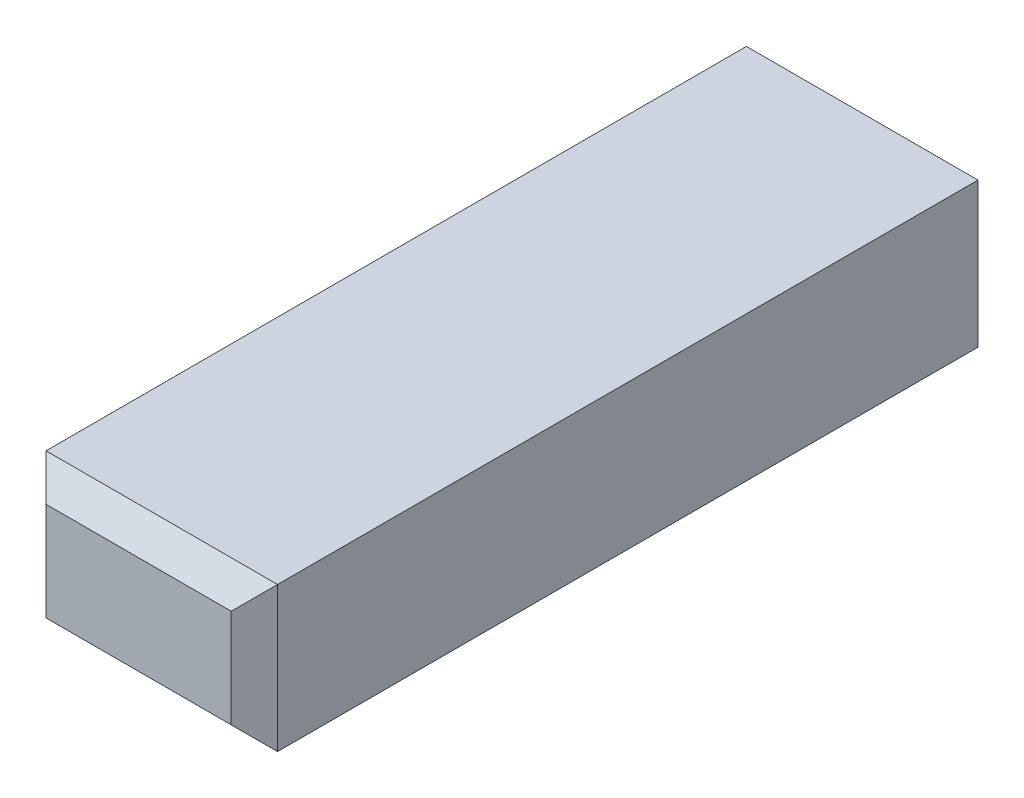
ISO-10303-21;
HEADER;
FILE_DESCRIPTION(('STEP AP214'),'2;1');
FILE_NAME('part.step','',(''),(''),'','','');
FILE_SCHEMA(('AUTOMOTIVE_DESIGN { 1 0 10303 214 1 1 1 1 }'));
ENDSEC;
DATA;
#1=APPLICATION_CONTEXT('core data for automotive mechanical design processes');
#2=APPLICATION_PROTOCOL_DEFINITION('international standard','automotive_design',2000,#1);
#3=PRODUCT_CONTEXT('',#1,'mechanical');
#4=PRODUCT('Part','Part','',(#3));
#5=PRODUCT_RELATED_PRODUCT_CATEGORY('part','',(#4));
#6=PRODUCT_DEFINITION_FORMATION('','',#4);
#7=PRODUCT_DEFINITION_CONTEXT('part definition',#1,'design');
#8=PRODUCT_DEFINITION('design','',#6,#7);
#9=PRODUCT_DEFINITION_SHAPE('','',#8);
#10=(LENGTH_UNIT() NAMED_UNIT(*) SI_UNIT(.MILLI.,.METRE.));
#11=(NAMED_UNIT(*) PLANE_ANGLE_UNIT() SI_UNIT($,.RADIAN.));
#12=(NAMED_UNIT(*) SI_UNIT($,.STERADIAN.) SOLID_ANGLE_UNIT());
#13=UNCERTAINTY_MEASURE_WITH_UNIT(LENGTH_MEASURE(1.E-05),#10,'distance_accuracy_value','');
#14=(GEOMETRIC_REPRESENTATION_CONTEXT(3) GLOBAL_UNCERTAINTY_ASSIGNED_CONTEXT((#13)) GLOBAL_UNIT_ASSIGNED_CONTEXT((#10,
#11,#12)) REPRESENTATION_CONTEXT('',''));
#15=CARTESIAN_POINT('',(0.,0.,0.));
#16=DIRECTION('',(0.,0.,1.));
#17=DIRECTION('',(1.,0.,0.));
#18=AXIS2_PLACEMENT_3D('',#15,#16,#17);
#19=CARTESIAN_POINT('',(8.,-5.,25.));
#20=DIRECTION('',(-1.,0.,0.));
#21=DIRECTION('',(0.,0.,1.));
#22=AXIS2_PLACEMENT_3D('',#19,#20,#21);
#23=PLANE('',#22);
#24=DIRECTION('',(0.,0.,-1.));
#25=VECTOR('',#24,1.);
#26=CARTESIAN_POINT('',(8.,5.,25.));
#27=LINE('',#26,#25);
#28=CARTESIAN_POINT('',(8.,5.,23.4));
#29=VERTEX_POINT('',#28);
#30=CARTESIAN_POINT('',(8.,5.,-25.));
#31=VERTEX_POINT('',#30);
#32=EDGE_CURVE('E84',#29,#31,#27,.T.);
#33=ORIENTED_EDGE('',*,*,#32,.F.);
#34=DIRECTION('',(0.,-1.,0.));
#35=VECTOR('',#34,1.);
#36=CARTESIAN_POINT('',(8.,-5.,23.4));
#37=LINE('',#36,#35);
#38=CARTESIAN_POINT('',(8.,-5.,23.4));
#39=VERTEX_POINT('',#38);
#40=EDGE_CURVE('E11',#29,#39,#37,.T.);
#41=ORIENTED_EDGE('',*,*,#40,.T.);
#42=DIRECTION('',(0.,0.,-1.));
#43=VECTOR('',#42,1.);
#44=CARTESIAN_POINT('',(8.,-5.,25.));
#45=LINE('',#44,#43);
#46=CARTESIAN_POINT('',(8.,-5.,-25.));
#47=VERTEX_POINT('',#46);
#48=EDGE_CURVE('E104',#39,#47,#45,.T.);
#49=ORIENTED_EDGE('',*,*,#48,.T.);
#50=DIRECTION('',(0.,1.,0.));
#51=VECTOR('',#50,1.);
#52=CARTESIAN_POINT('',(8.,-5.,-25.));
#53=LINE('',#52,#51);
#54=EDGE_CURVE('E99',#47,#31,#53,.T.);
#55=ORIENTED_EDGE('',*,*,#54,.T.);
#56=EDGE_LOOP('',(#33,#41,#49,#55));
#57=FACE_BOUND('',#56,.T.);
#58=ADVANCED_FACE('F32',(#57),#23,.F.);
#59=CARTESIAN_POINT('',(-8.,5.,25.));
#60=DIRECTION('',(0.,-1.,0.));
#61=DIRECTION('',(0.,0.,-1.));
#62=AXIS2_PLACEMENT_3D('',#59,#60,#61);
#63=PLANE('',#62);
#64=DIRECTION('',(0.,0.,-1.));
#65=VECTOR('',#64,1.);
#66=CARTESIAN_POINT('',(-8.,5.,25.));
#67=LINE('',#66,#65);
#68=CARTESIAN_POINT('',(-8.,5.,23.4));
#69=VERTEX_POINT('',#68);
#70=CARTESIAN_POINT('',(-8.,5.,-25.));
#71=VERTEX_POINT('',#70);
#72=EDGE_CURVE('E93',#69,#71,#67,.T.);
#73=ORIENTED_EDGE('',*,*,#72,.F.);
#74=DIRECTION('',(1.,0.,0.));
#75=VECTOR('',#74,1.);
#76=CARTESIAN_POINT('',(-8.,5.,23.4));
#77=LINE('',#76,#75);
#78=EDGE_CURVE('E41',#69,#29,#77,.T.);
#79=ORIENTED_EDGE('',*,*,#78,.T.);
#80=ORIENTED_EDGE('',*,*,#32,.T.);
#81=DIRECTION('',(-1.,0.,0.));
#82=VECTOR('',#81,1.);
#83=CARTESIAN_POINT('',(-8.,5.,-25.));
#84=LINE('',#83,#82);
#85=EDGE_CURVE('E87',#31,#71,#84,.T.);
#86=ORIENTED_EDGE('',*,*,#85,.T.);
#87=EDGE_LOOP('',(#73,#79,#80,#86));
#88=FACE_BOUND('',#87,.T.);
#89=ADVANCED_FACE('F86',(#88),#63,.F.);
#90=CARTESIAN_POINT('',(-8.,-5.,25.));
#91=DIRECTION('',(1.,0.,0.));
#92=DIRECTION('',(0.,0.,-1.));
#93=AXIS2_PLACEMENT_3D('',#90,#91,#92);
#94=PLANE('',#93);
#95=DIRECTION('',(0.,0.,-1.));
#96=VECTOR('',#95,1.);
#97=CARTESIAN_POINT('',(-8.,-5.,25.));
#98=LINE('',#97,#96);
#99=CARTESIAN_POINT('',(-8.,-5.,23.4));
#100=VERTEX_POINT('',#99);
#101=CARTESIAN_POINT('',(-8.,-5.,-25.));
#102=VERTEX_POINT('',#101);
#103=EDGE_CURVE('E114',#100,#102,#98,.T.);
#104=ORIENTED_EDGE('',*,*,#103,.F.);
#105=DIRECTION('',(0.,1.,0.));
#106=VECTOR('',#105,1.);
#107=CARTESIAN_POINT('',(-8.,-5.,23.4));
#108=LINE('',#107,#106);
#109=EDGE_CURVE('E56',#100,#69,#108,.T.);
#110=ORIENTED_EDGE('',*,*,#109,.T.);
#111=ORIENTED_EDGE('',*,*,#72,.T.);
#112=DIRECTION('',(0.,-1.,0.));
#113=VECTOR('',#112,1.);
#114=CARTESIAN_POINT('',(-8.,-5.,-25.));
#115=LINE('',#114,#113);
#116=EDGE_CURVE('E101',#71,#102,#115,.T.);
#117=ORIENTED_EDGE('',*,*,#116,.T.);
#118=EDGE_LOOP('',(#104,#110,#111,#117));
#119=FACE_BOUND('',#118,.T.);
#120=ADVANCED_FACE('F152',(#119),#94,.F.);
#121=CARTESIAN_POINT('',(-8.,-5.,25.));
#122=DIRECTION('',(0.,1.,0.));
#123=DIRECTION('',(0.,0.,1.));
#124=AXIS2_PLACEMENT_3D('',#121,#122,#123);
#125=PLANE('',#124);
#126=ORIENTED_EDGE('',*,*,#48,.F.);
#127=DIRECTION('',(-1.,0.,0.));
#128=VECTOR('',#127,1.);
#129=CARTESIAN_POINT('',(-8.,-5.,23.4));
#130=LINE('',#129,#128);
#131=EDGE_CURVE('E125',#39,#100,#130,.T.);
#132=ORIENTED_EDGE('',*,*,#131,.T.);
#133=ORIENTED_EDGE('',*,*,#103,.T.);
#134=DIRECTION('',(1.,0.,0.));
#135=VECTOR('',#134,1.);
#136=CARTESIAN_POINT('',(-8.,-5.,-25.));
#137=LINE('',#136,#135);
#138=EDGE_CURVE('E111',#102,#47,#137,.T.);
#139=ORIENTED_EDGE('',*,*,#138,.T.);
#140=EDGE_LOOP('',(#126,#132,#133,#139));
#141=FACE_BOUND('',#140,.T.);
#142=ADVANCED_FACE('F151',(#141),#125,.F.);
#143=CARTESIAN_POINT('',(0.,0.,25.));
#144=DIRECTION('',(0.,0.,-1.));
#145=DIRECTION('',(-1.,0.,0.));
#146=AXIS2_PLACEMENT_3D('',#143,#144,#145);
#147=PLANE('',#146);
#148=DIRECTION('',(0.,-1.,0.));
#149=VECTOR('',#148,1.);
#150=CARTESIAN_POINT('',(-6.39999999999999,0.,25.));
#151=LINE('',#150,#149);
#152=CARTESIAN_POINT('',(-6.39999999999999,3.39999999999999,25.));
#153=VERTEX_POINT('',#152);
#154=CARTESIAN_POINT('',(-6.39999999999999,-3.39999999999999,25.));
#155=VERTEX_POINT('',#154);
#156=EDGE_CURVE('E120',#153,#155,#151,.T.);
#157=ORIENTED_EDGE('',*,*,#156,.T.);
#158=DIRECTION('',(1.,0.,0.));
#159=VECTOR('',#158,1.);
#160=CARTESIAN_POINT('',(0.,-3.39999999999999,25.));
#161=LINE('',#160,#159);
#162=CARTESIAN_POINT('',(6.39999999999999,-3.39999999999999,25.));
#163=VERTEX_POINT('',#162);
#164=EDGE_CURVE('E122',#155,#163,#161,.T.);
#165=ORIENTED_EDGE('',*,*,#164,.T.);
#166=DIRECTION('',(0.,1.,0.));
#167=VECTOR('',#166,1.);
#168=CARTESIAN_POINT('',(6.39999999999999,0.,25.));
#169=LINE('',#168,#167);
#170=CARTESIAN_POINT('',(6.39999999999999,3.39999999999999,25.));
#171=VERTEX_POINT('',#170);
#172=EDGE_CURVE('E92',#163,#171,#169,.T.);
#173=ORIENTED_EDGE('',*,*,#172,.T.);
#174=DIRECTION('',(-1.,0.,0.));
#175=VECTOR('',#174,1.);
#176=CARTESIAN_POINT('',(0.,3.39999999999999,25.));
#177=LINE('',#176,#175);
#178=EDGE_CURVE('E118',#171,#153,#177,.T.);
#179=ORIENTED_EDGE('',*,*,#178,.T.);
#180=EDGE_LOOP('',(#157,#165,#173,#179));
#181=FACE_BOUND('',#180,.T.);
#182=ADVANCED_FACE('F144',(#181),#147,.F.);
#183=CARTESIAN_POINT('',(0.,0.,-25.));
#184=DIRECTION('',(0.,0.,-1.));
#185=DIRECTION('',(-1.,0.,0.));
#186=AXIS2_PLACEMENT_3D('',#183,#184,#185);
#187=PLANE('',#186);
#188=ORIENTED_EDGE('',*,*,#54,.F.);
#189=ORIENTED_EDGE('',*,*,#138,.F.);
#190=ORIENTED_EDGE('',*,*,#116,.F.);
#191=ORIENTED_EDGE('',*,*,#85,.F.);
#192=EDGE_LOOP('',(#188,#189,#190,#191));
#193=FACE_BOUND('',#192,.T.);
#194=ADVANCED_FACE('F97',(#193),#187,.T.);
#195=CARTESIAN_POINT('',(0.,3.39999999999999,25.));
#196=DIRECTION('',(0.,-0.707106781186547,-0.707106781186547));
#197=DIRECTION('',(-1.,0.,0.));
#198=AXIS2_PLACEMENT_3D('',#195,#196,#197);
#199=PLANE('',#198);
#200=DIRECTION('',(-0.577350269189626,-0.577350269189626,0.577350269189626));
#201=VECTOR('',#200,1.);
#202=CARTESIAN_POINT('',(5.26666666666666,2.26666666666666,26.1333333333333));
#203=LINE('',#202,#201);
#204=EDGE_CURVE('E108',#29,#171,#203,.T.);
#205=ORIENTED_EDGE('',*,*,#204,.F.);
#206=ORIENTED_EDGE('',*,*,#78,.F.);
#207=DIRECTION('',(0.577350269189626,-0.577350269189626,0.577350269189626));
#208=VECTOR('',#207,1.);
#209=CARTESIAN_POINT('',(-4.26666666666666,1.26666666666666,27.1333333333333));
#210=LINE('',#209,#208);
#211=EDGE_CURVE('E36',#153,#69,#210,.F.);
#212=ORIENTED_EDGE('',*,*,#211,.F.);
#213=ORIENTED_EDGE('',*,*,#178,.F.);
#214=EDGE_LOOP('',(#205,#206,#212,#213));
#215=FACE_BOUND('',#214,.T.);
#216=ADVANCED_FACE('F34',(#215),#199,.F.);
#217=CARTESIAN_POINT('',(-6.39999999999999,0.,25.));
#218=DIRECTION('',(0.707106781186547,0.,-0.707106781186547));
#219=DIRECTION('',(0.,-1.,0.));
#220=AXIS2_PLACEMENT_3D('',#217,#218,#219);
#221=PLANE('',#220);
#222=ORIENTED_EDGE('',*,*,#211,.T.);
#223=ORIENTED_EDGE('',*,*,#109,.F.);
#224=DIRECTION('',(0.577350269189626,0.577350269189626,0.577350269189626));
#225=VECTOR('',#224,1.);
#226=CARTESIAN_POINT('',(-5.26666666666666,-2.26666666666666,26.1333333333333));
#227=LINE('',#226,#225);
#228=EDGE_CURVE('E132',#155,#100,#227,.F.);
#229=ORIENTED_EDGE('',*,*,#228,.F.);
#230=ORIENTED_EDGE('',*,*,#156,.F.);
#231=EDGE_LOOP('',(#222,#223,#229,#230));
#232=FACE_BOUND('',#231,.T.);
#233=ADVANCED_FACE('F169',(#232),#221,.F.);
#234=CARTESIAN_POINT('',(6.39999999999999,0.,25.));
#235=DIRECTION('',(-0.707106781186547,0.,-0.707106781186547));
#236=DIRECTION('',(0.,1.,0.));
#237=AXIS2_PLACEMENT_3D('',#234,#235,#236);
#238=PLANE('',#237);
#239=ORIENTED_EDGE('',*,*,#204,.T.);
#240=ORIENTED_EDGE('',*,*,#172,.F.);
#241=DIRECTION('',(0.577350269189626,-0.577350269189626,-0.577350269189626));
#242=VECTOR('',#241,1.);
#243=CARTESIAN_POINT('',(5.26666666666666,-2.26666666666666,26.1333333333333));
#244=LINE('',#243,#242);
#245=EDGE_CURVE('E130',#39,#163,#244,.F.);
#246=ORIENTED_EDGE('',*,*,#245,.F.);
#247=ORIENTED_EDGE('',*,*,#40,.F.);
#248=EDGE_LOOP('',(#239,#240,#246,#247));
#249=FACE_BOUND('',#248,.T.);
#250=ADVANCED_FACE('F137',(#249),#238,.F.);
#251=CARTESIAN_POINT('',(0.,-3.39999999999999,25.));
#252=DIRECTION('',(0.,0.707106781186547,-0.707106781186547));
#253=DIRECTION('',(1.,0.,0.));
#254=AXIS2_PLACEMENT_3D('',#251,#252,#253);
#255=PLANE('',#254);
#256=ORIENTED_EDGE('',*,*,#228,.T.);
#257=ORIENTED_EDGE('',*,*,#131,.F.);
#258=ORIENTED_EDGE('',*,*,#245,.T.);
#259=ORIENTED_EDGE('',*,*,#164,.F.);
#260=EDGE_LOOP('',(#256,#257,#258,#259));
#261=FACE_BOUND('',#260,.T.);
#262=ADVANCED_FACE('F148',(#261),#255,.F.);
#263=CLOSED_SHELL('',(#58,#89,#120,#142,#182,#194,#216,#233,#250,#262));
#264=MANIFOLD_SOLID_BREP('B2',#263);
#265=ADVANCED_BREP_SHAPE_REPRESENTATION('',(#18,#264),#14);
#266=SHAPE_DEFINITION_REPRESENTATION(#9,#265);
ENDSEC;
END-ISO-10303-21;
